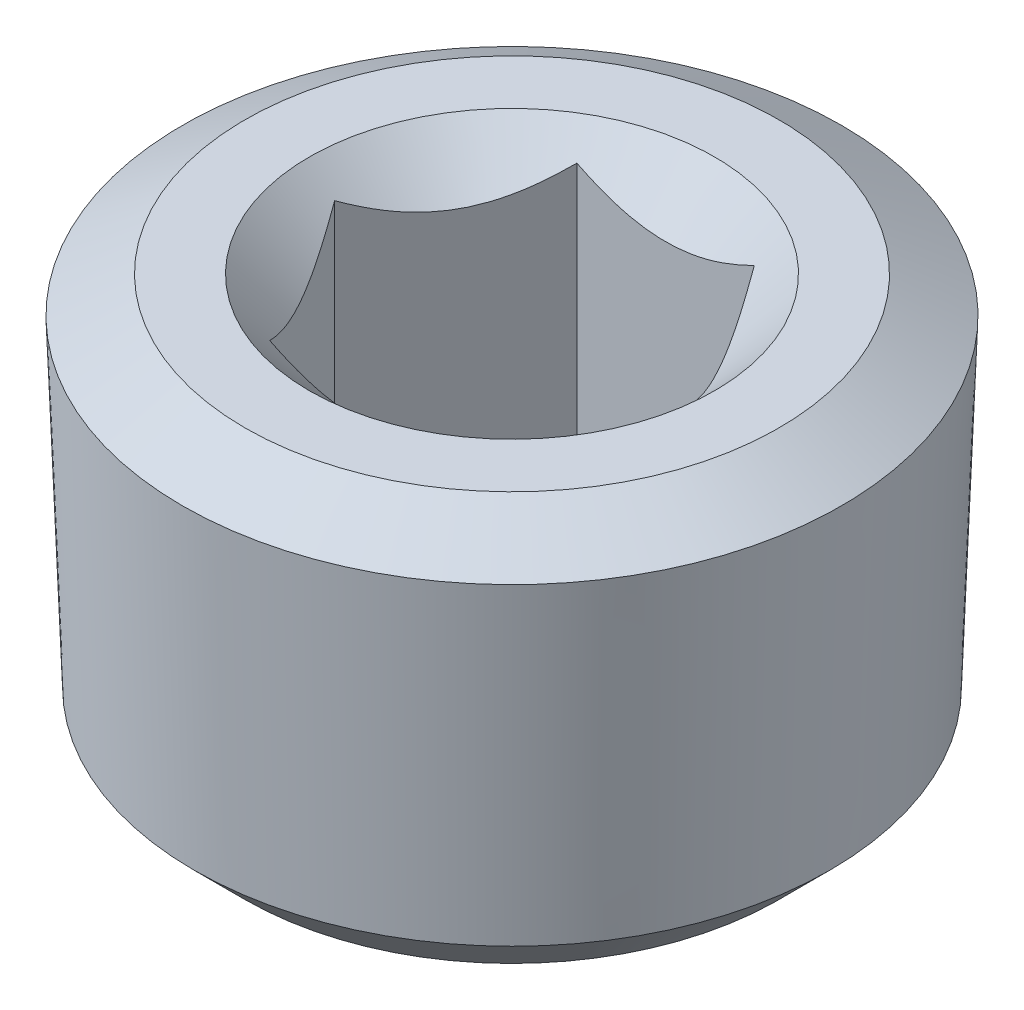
ISO-10303-21;
HEADER;
FILE_DESCRIPTION(('STEP AP214'),'2;1');
FILE_NAME('part.step','',(''),(''),'','','');
FILE_SCHEMA(('AUTOMOTIVE_DESIGN { 1 0 10303 214 1 1 1 1 }'));
ENDSEC;
DATA;
#1=APPLICATION_CONTEXT('core data for automotive mechanical design processes');
#2=APPLICATION_PROTOCOL_DEFINITION('international standard','automotive_design',2000,#1);
#3=PRODUCT_CONTEXT('',#1,'mechanical');
#4=PRODUCT('Part','Part','',(#3));
#5=PRODUCT_RELATED_PRODUCT_CATEGORY('part','',(#4));
#6=PRODUCT_DEFINITION_FORMATION('','',#4);
#7=PRODUCT_DEFINITION_CONTEXT('part definition',#1,'design');
#8=PRODUCT_DEFINITION('design','',#6,#7);
#9=PRODUCT_DEFINITION_SHAPE('','',#8);
#10=(LENGTH_UNIT() NAMED_UNIT(*) SI_UNIT(.MILLI.,.METRE.));
#11=(NAMED_UNIT(*) PLANE_ANGLE_UNIT() SI_UNIT($,.RADIAN.));
#12=(NAMED_UNIT(*) SI_UNIT($,.STERADIAN.) SOLID_ANGLE_UNIT());
#13=UNCERTAINTY_MEASURE_WITH_UNIT(LENGTH_MEASURE(1.E-05),#10,'distance_accuracy_value','');
#14=(GEOMETRIC_REPRESENTATION_CONTEXT(3) GLOBAL_UNCERTAINTY_ASSIGNED_CONTEXT((#13)) GLOBAL_UNIT_ASSIGNED_CONTEXT((#10,
#11,#12)) REPRESENTATION_CONTEXT('',''));
#15=CARTESIAN_POINT('',(0.,0.,0.));
#16=DIRECTION('',(0.,0.,1.));
#17=DIRECTION('',(1.,0.,0.));
#18=AXIS2_PLACEMENT_3D('',#15,#16,#17);
#19=CARTESIAN_POINT('',(0.,0.,0.));
#20=DIRECTION('',(0.,1.,0.));
#21=DIRECTION('',(0.,0.,1.));
#22=AXIS2_PLACEMENT_3D('',#19,#20,#21);
#23=PLANE('',#22);
#24=CARTESIAN_POINT('',(0.,0.,0.));
#25=DIRECTION('',(0.,1.,0.));
#26=DIRECTION('',(0.,0.,1.));
#27=AXIS2_PLACEMENT_3D('',#24,#25,#26);
#28=CIRCLE('',#27,3.1496);
#29=CARTESIAN_POINT('',(0.,0.,3.1496));
#30=VERTEX_POINT('',#29);
#31=EDGE_CURVE('E238',#30,#30,#28,.T.);
#32=ORIENTED_EDGE('',*,*,#31,.F.);
#33=EDGE_LOOP('',(#32));
#34=FACE_BOUND('',#33,.T.);
#35=CARTESIAN_POINT('',(0.,0.,0.));
#36=DIRECTION('',(0.,1.,0.));
#37=DIRECTION('',(0.,0.,1.));
#38=AXIS2_PLACEMENT_3D('',#35,#36,#37);
#39=CIRCLE('',#38,4.14998778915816);
#40=CARTESIAN_POINT('',(0.,0.,4.14998778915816));
#41=VERTEX_POINT('',#40);
#42=EDGE_CURVE('E12',#41,#41,#39,.T.);
#43=ORIENTED_EDGE('',*,*,#42,.T.);
#44=EDGE_LOOP('',(#43));
#45=FACE_BOUND('',#44,.T.);
#46=ADVANCED_FACE('F33',(#34,#45),#23,.T.);
#47=CARTESIAN_POINT('',(0.,0.,0.));
#48=DIRECTION('',(0.,-1.,0.));
#49=DIRECTION('',(0.,0.,-1.));
#50=AXIS2_PLACEMENT_3D('',#47,#48,#49);
#51=CONICAL_SURFACE('',#50,4.14998778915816,1.0471975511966);
#52=CARTESIAN_POINT('',(0.,-0.561779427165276,0.));
#53=DIRECTION('',(0.,1.,0.));
#54=DIRECTION('',(0.,0.,1.));
#55=AXIS2_PLACEMENT_3D('',#52,#53,#54);
#56=CIRCLE('',#55,5.12301829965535);
#57=CARTESIAN_POINT('',(0.,-0.561779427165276,5.12301829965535));
#58=VERTEX_POINT('',#57);
#59=EDGE_CURVE('E40',#58,#58,#56,.T.);
#60=ORIENTED_EDGE('',*,*,#59,.T.);
#61=EDGE_LOOP('',(#60));
#62=FACE_BOUND('',#61,.T.);
#63=ORIENTED_EDGE('',*,*,#42,.F.);
#64=EDGE_LOOP('',(#63));
#65=FACE_BOUND('',#64,.T.);
#66=ADVANCED_FACE('F228',(#62,#65),#51,.T.);
#67=CARTESIAN_POINT('',(0.,-0.561779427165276,0.));
#68=DIRECTION('',(0.,1.,0.));
#69=DIRECTION('',(0.,0.,1.));
#70=AXIS2_PLACEMENT_3D('',#67,#68,#69);
#71=CONICAL_SURFACE('',#70,5.12301829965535,0.0364424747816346);
#72=CARTESIAN_POINT('',(0.,-5.55916733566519,0.));
#73=DIRECTION('',(0.,1.,0.));
#74=DIRECTION('',(0.,0.,1.));
#75=AXIS2_PLACEMENT_3D('',#72,#73,#74);
#76=CIRCLE('',#75,4.94082045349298);
#77=CARTESIAN_POINT('',(0.,-5.55916733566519,4.94082045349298));
#78=VERTEX_POINT('',#77);
#79=EDGE_CURVE('E246',#78,#78,#76,.T.);
#80=ORIENTED_EDGE('',*,*,#79,.T.);
#81=EDGE_LOOP('',(#80));
#82=FACE_BOUND('',#81,.T.);
#83=ORIENTED_EDGE('',*,*,#59,.F.);
#84=EDGE_LOOP('',(#83));
#85=FACE_BOUND('',#84,.T.);
#86=ADVANCED_FACE('F233',(#82,#85),#71,.T.);
#87=CARTESIAN_POINT('',(0.,-5.55916733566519,0.));
#88=DIRECTION('',(0.,1.,0.));
#89=DIRECTION('',(0.,0.,1.));
#90=AXIS2_PLACEMENT_3D('',#87,#88,#89);
#91=CONICAL_SURFACE('',#90,4.94082045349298,0.785398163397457);
#92=CARTESIAN_POINT('',(0.,-6.35,0.));
#93=DIRECTION('',(0.,1.,0.));
#94=DIRECTION('',(0.,0.,1.));
#95=AXIS2_PLACEMENT_3D('',#92,#93,#94);
#96=CIRCLE('',#95,4.14998778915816);
#97=CARTESIAN_POINT('',(0.,-6.35,4.14998778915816));
#98=VERTEX_POINT('',#97);
#99=EDGE_CURVE('E242',#98,#98,#96,.T.);
#100=ORIENTED_EDGE('',*,*,#99,.T.);
#101=EDGE_LOOP('',(#100));
#102=FACE_BOUND('',#101,.T.);
#103=ORIENTED_EDGE('',*,*,#79,.F.);
#104=EDGE_LOOP('',(#103));
#105=FACE_BOUND('',#104,.T.);
#106=ADVANCED_FACE('F257',(#102,#105),#91,.T.);
#107=CARTESIAN_POINT('',(-4.14998778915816,-6.35,0.));
#108=DIRECTION('',(0.,-1.,0.));
#109=DIRECTION('',(0.,0.,-1.));
#110=AXIS2_PLACEMENT_3D('',#107,#108,#109);
#111=PLANE('',#110);
#112=ORIENTED_EDGE('',*,*,#99,.F.);
#113=EDGE_LOOP('',(#112));
#114=FACE_BOUND('',#113,.T.);
#115=ADVANCED_FACE('F175',(#114),#111,.T.);
#116=CARTESIAN_POINT('',(0.,0.,0.));
#117=DIRECTION('',(0.,1.,0.));
#118=DIRECTION('',(0.,0.,1.));
#119=AXIS2_PLACEMENT_3D('',#116,#117,#118);
#120=CONICAL_SURFACE('',#119,3.1496,0.785398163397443);
#121=CARTESIAN_POINT('',(-3.46242077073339,1.05622826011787,2.3876));
#122=CARTESIAN_POINT('',(-3.37526911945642,0.984499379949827,2.3876));
#123=CARTESIAN_POINT('',(-3.28770245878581,0.913266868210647,2.3876));
#124=CARTESIAN_POINT('',(-3.11152582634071,0.772059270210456,2.3876));
#125=CARTESIAN_POINT('',(-3.02291559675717,0.702084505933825,2.3876));
#126=CARTESIAN_POINT('',(-2.84349874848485,0.562930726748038,2.3876));
#127=CARTESIAN_POINT('',(-2.75267868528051,0.493768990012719,2.3876));
#128=CARTESIAN_POINT('',(-2.56954860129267,0.357460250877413,2.3876));
#129=CARTESIAN_POINT('',(-2.47723872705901,0.290313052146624,2.3876));
#130=CARTESIAN_POINT('',(-2.28188792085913,0.152280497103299,2.3876));
#131=CARTESIAN_POINT('',(-2.17866480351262,0.0816515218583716,2.3876));
#132=CARTESIAN_POINT('',(-1.96947715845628,-0.0555359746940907,2.3876));
#133=CARTESIAN_POINT('',(-1.86351173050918,-0.122093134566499,2.3876));
#134=CARTESIAN_POINT('',(-1.64874800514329,-0.249332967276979,2.3876));
#135=CARTESIAN_POINT('',(-1.53996523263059,-0.310041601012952,2.3876));
#136=CARTESIAN_POINT('',(-1.31849805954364,-0.423788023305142,2.3876));
#137=CARTESIAN_POINT('',(-1.20581720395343,-0.476832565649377,2.3876));
#138=CARTESIAN_POINT('',(-1.00970710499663,-0.558326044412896,2.3876));
#139=CARTESIAN_POINT('',(-0.92738768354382,-0.589426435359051,2.3876));
#140=CARTESIAN_POINT('',(-0.760502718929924,-0.645041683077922,2.3876));
#141=CARTESIAN_POINT('',(-0.675936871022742,-0.669555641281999,2.3876));
#142=CARTESIAN_POINT('',(-0.506786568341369,-0.710155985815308,2.3876));
#143=CARTESIAN_POINT('',(-0.422245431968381,-0.726419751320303,2.3876));
#144=CARTESIAN_POINT('',(-0.251935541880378,-0.750223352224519,2.3876));
#145=CARTESIAN_POINT('',(-0.166167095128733,-0.757765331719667,2.3876));
#146=CARTESIAN_POINT('',(0.00107034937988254,-0.763383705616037,2.3876));
#147=CARTESIAN_POINT('',(0.0825230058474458,-0.761946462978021,2.3876));
#148=CARTESIAN_POINT('',(0.244859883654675,-0.750844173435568,2.3876));
#149=CARTESIAN_POINT('',(0.325744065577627,-0.741178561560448,2.3876));
#150=CARTESIAN_POINT('',(0.487775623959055,-0.71402033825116,2.3876));
#151=CARTESIAN_POINT('',(0.568897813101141,-0.696379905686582,2.3876));
#152=CARTESIAN_POINT('',(0.729317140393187,-0.654295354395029,2.3876));
#153=CARTESIAN_POINT('',(0.808614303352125,-0.629851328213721,2.3876));
#154=CARTESIAN_POINT('',(1.04680074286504,-0.546928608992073,2.3876));
#155=CARTESIAN_POINT('',(1.20258605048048,-0.479514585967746,2.3876));
#156=CARTESIAN_POINT('',(1.43061079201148,-0.36699056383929,2.3876));
#157=CARTESIAN_POINT('',(1.50581378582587,-0.32749643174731,2.3876));
#158=CARTESIAN_POINT('',(1.65452246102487,-0.245425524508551,2.3876));
#159=CARTESIAN_POINT('',(1.72802843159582,-0.202849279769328,2.3876));
#160=CARTESIAN_POINT('',(1.86994165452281,-0.117394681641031,2.3876));
#161=CARTESIAN_POINT('',(1.93842134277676,-0.0746352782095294,2.3876));
#162=CARTESIAN_POINT('',(2.07420549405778,0.0127190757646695,2.3876));
#163=CARTESIAN_POINT('',(2.14150986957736,0.0573141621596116,2.3876));
#164=CARTESIAN_POINT('',(2.27455924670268,0.147653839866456,2.3876));
#165=CARTESIAN_POINT('',(2.34031238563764,0.19338649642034,2.3876));
#166=CARTESIAN_POINT('',(2.47091456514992,0.286088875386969,2.3876));
#167=CARTESIAN_POINT('',(2.53576384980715,0.333058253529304,2.3876));
#168=CARTESIAN_POINT('',(2.60023368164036,0.380534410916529,2.3876));
#169=B_SPLINE_CURVE_WITH_KNOTS('',3,(#121,#122,#123,#124,#125,#126,#127,#128,#129,#130,#131,
#132,#133,#134,#135,#136,#137,#138,#139,#140,#141,#142,#143,#144,#145,#146,#147,#148,#149,#150,
#151,#152,#153,#154,#155,#156,#157,#158,#159,#160,#161,#162,#163,#164,#165,#166,#167,#168),
.UNSPECIFIED.,.F.,.F.,(4,2,2,2,2,2,2,2,2,2,2,2,2,2,2,2,2,2,2,2,2,2,2,4),(0.,0.33862629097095,
0.677338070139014,1.01978408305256,1.3621966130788,1.73734628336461,2.11262070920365,
2.48614413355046,2.85933636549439,3.12311223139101,3.38692406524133,3.64479404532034,
3.90260061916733,4.14656864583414,4.39055342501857,4.6392589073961,4.88796100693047,
5.39563913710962,5.65044461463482,5.90520634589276,6.14737581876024,6.38956324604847,
6.62982819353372,6.87002695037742),.UNSPECIFIED.);
#170=CARTESIAN_POINT('',(1.37848150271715,-0.392636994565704,2.3876));
#171=VERTEX_POINT('',#170);
#172=CARTESIAN_POINT('',(-1.37848150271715,-0.392636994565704,2.3876));
#173=VERTEX_POINT('',#172);
#174=EDGE_CURVE('E47',#171,#173,#169,.F.);
#175=ORIENTED_EDGE('',*,*,#174,.T.);
#176=CARTESIAN_POINT('',(-1.37836603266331,-0.392521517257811,2.3878));
#177=CARTESIAN_POINT('',(-1.42575207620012,-0.439867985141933,2.30572496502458));
#178=CARTESIAN_POINT('',(-1.47393048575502,-0.484433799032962,2.22227751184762));
#179=CARTESIAN_POINT('',(-1.57217161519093,-0.566032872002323,2.05211888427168));
#180=CARTESIAN_POINT('',(-1.62224367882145,-0.603020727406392,1.96539152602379));
#181=CARTESIAN_POINT('',(-1.72321161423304,-0.666381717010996,1.79050993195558));
#182=CARTESIAN_POINT('',(-1.77408177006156,-0.692914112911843,1.70240023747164));
#183=CARTESIAN_POINT('',(-1.87694201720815,-0.733792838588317,1.52424106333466));
#184=CARTESIAN_POINT('',(-1.92892896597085,-0.748169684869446,1.4341970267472));
#185=CARTESIAN_POINT('',(-2.01852512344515,-0.761141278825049,1.27901192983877));
#186=CARTESIAN_POINT('',(-2.05601857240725,-0.763061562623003,1.2140713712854));
#187=CARTESIAN_POINT('',(-2.13094418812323,-0.759826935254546,1.08429639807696));
#188=CARTESIAN_POINT('',(-2.16837632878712,-0.754669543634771,1.01946202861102));
#189=CARTESIAN_POINT('',(-2.24288716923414,-0.737573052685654,0.890405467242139));
#190=CARTESIAN_POINT('',(-2.2799654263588,-0.725626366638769,0.826184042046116));
#191=CARTESIAN_POINT('',(-2.35348076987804,-0.695607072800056,0.698851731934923));
#192=CARTESIAN_POINT('',(-2.38991790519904,-0.677534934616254,0.635740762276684));
#193=CARTESIAN_POINT('',(-2.48325004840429,-0.623883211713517,0.474084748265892));
#194=CARTESIAN_POINT('',(-2.53956632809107,-0.584259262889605,0.376542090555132));
#195=CARTESIAN_POINT('',(-2.62237445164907,-0.517368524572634,0.233114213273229));
#196=CARTESIAN_POINT('',(-2.64966342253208,-0.493866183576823,0.185848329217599));
#197=CARTESIAN_POINT('',(-2.70373586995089,-0.444719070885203,0.092192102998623));
#198=CARTESIAN_POINT('',(-2.73051964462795,-0.419075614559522,0.045801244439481));
#199=CARTESIAN_POINT('',(-2.75707847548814,-0.39252151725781,-0.000199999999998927));
#200=B_SPLINE_CURVE_WITH_KNOTS('',3,(#176,#177,#178,#179,#180,#181,#182,#183,#184,#185,#186,
#187,#188,#189,#190,#191,#192,#193,#194,#195,#196,#197,#198,#199),.UNSPECIFIED.,.F.,.F.,(4,2,2,
2,2,2,2,2,2,2,2,4),(0.,0.318042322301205,0.637937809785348,0.952752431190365,1.26677434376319,
1.49149028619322,1.71628500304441,1.94133141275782,2.16636057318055,2.52380766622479,
2.70204658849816,2.88017680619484),.UNSPECIFIED.);
#201=CARTESIAN_POINT('',(-2.7569630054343,-0.392636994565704,0.));
#202=VERTEX_POINT('',#201);
#203=EDGE_CURVE('E119',#173,#202,#200,.T.);
#204=ORIENTED_EDGE('',*,*,#203,.T.);
#205=CARTESIAN_POINT('',(-2.75707847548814,-0.39252151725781,0.000200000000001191));
#206=CARTESIAN_POINT('',(-2.70969243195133,-0.439867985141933,-0.0818750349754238));
#207=CARTESIAN_POINT('',(-2.66151402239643,-0.484433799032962,-0.165322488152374));
#208=CARTESIAN_POINT('',(-2.56327289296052,-0.566032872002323,-0.335481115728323));
#209=CARTESIAN_POINT('',(-2.51320082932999,-0.603020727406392,-0.422208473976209));
#210=CARTESIAN_POINT('',(-2.4122328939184,-0.666381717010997,-0.597090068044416));
#211=CARTESIAN_POINT('',(-2.36136273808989,-0.692914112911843,-0.685199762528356));
#212=CARTESIAN_POINT('',(-2.2585024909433,-0.733792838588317,-0.863358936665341));
#213=CARTESIAN_POINT('',(-2.2065155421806,-0.748169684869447,-0.953402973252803));
#214=CARTESIAN_POINT('',(-2.1169193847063,-0.76114127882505,-1.10858807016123));
#215=CARTESIAN_POINT('',(-2.07942593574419,-0.763061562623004,-1.1735286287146));
#216=CARTESIAN_POINT('',(-2.00450032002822,-0.759826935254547,-1.30330360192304));
#217=CARTESIAN_POINT('',(-1.96706817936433,-0.754669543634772,-1.36813797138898));
#218=CARTESIAN_POINT('',(-1.89255733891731,-0.737573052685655,-1.49719453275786));
#219=CARTESIAN_POINT('',(-1.85547908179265,-0.725626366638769,-1.56141595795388));
#220=CARTESIAN_POINT('',(-1.78196373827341,-0.695607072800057,-1.68874826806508));
#221=CARTESIAN_POINT('',(-1.74552660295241,-0.677534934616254,-1.75185923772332));
#222=CARTESIAN_POINT('',(-1.65219445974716,-0.623883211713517,-1.91351525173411));
#223=CARTESIAN_POINT('',(-1.59587818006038,-0.584259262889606,-2.01105790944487));
#224=CARTESIAN_POINT('',(-1.51307005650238,-0.517368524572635,-2.15448578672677));
#225=CARTESIAN_POINT('',(-1.48578108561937,-0.493866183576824,-2.2017516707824));
#226=CARTESIAN_POINT('',(-1.43170863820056,-0.444719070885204,-2.29540789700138));
#227=CARTESIAN_POINT('',(-1.4049248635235,-0.419075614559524,-2.34179875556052));
#228=CARTESIAN_POINT('',(-1.37836603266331,-0.392521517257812,-2.3878));
#229=B_SPLINE_CURVE_WITH_KNOTS('',3,(#205,#206,#207,#208,#209,#210,#211,#212,#213,#214,#215,
#216,#217,#218,#219,#220,#221,#222,#223,#224,#225,#226,#227,#228),.UNSPECIFIED.,.F.,.F.,(4,2,2,
2,2,2,2,2,2,2,2,4),(0.,0.318042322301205,0.637937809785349,0.952752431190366,1.26677434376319,
1.49149028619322,1.71628500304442,1.94133141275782,2.16636057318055,2.52380766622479,
2.70204658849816,2.88017680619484),.UNSPECIFIED.);
#230=CARTESIAN_POINT('',(-1.37848150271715,-0.392636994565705,-2.3876));
#231=VERTEX_POINT('',#230);
#232=EDGE_CURVE('E197',#202,#231,#229,.T.);
#233=ORIENTED_EDGE('',*,*,#232,.T.);
#234=CARTESIAN_POINT('',(-3.46242077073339,1.05622826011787,-2.3876));
#235=CARTESIAN_POINT('',(-3.37526911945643,0.984499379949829,-2.3876));
#236=CARTESIAN_POINT('',(-3.28770245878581,0.91326686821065,-2.3876));
#237=CARTESIAN_POINT('',(-3.11152582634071,0.772059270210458,-2.3876));
#238=CARTESIAN_POINT('',(-3.02291559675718,0.702084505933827,-2.3876));
#239=CARTESIAN_POINT('',(-2.84349874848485,0.56293072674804,-2.3876));
#240=CARTESIAN_POINT('',(-2.75267868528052,0.49376899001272,-2.3876));
#241=CARTESIAN_POINT('',(-2.56954860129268,0.357460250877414,-2.3876));
#242=CARTESIAN_POINT('',(-2.47723872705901,0.290313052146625,-2.3876));
#243=CARTESIAN_POINT('',(-2.28188792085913,0.1522804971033,-2.3876));
#244=CARTESIAN_POINT('',(-2.17866480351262,0.081651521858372,-2.3876));
#245=CARTESIAN_POINT('',(-1.96947715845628,-0.0555359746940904,-2.3876));
#246=CARTESIAN_POINT('',(-1.86351173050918,-0.122093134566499,-2.3876));
#247=CARTESIAN_POINT('',(-1.64874800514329,-0.249332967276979,-2.3876));
#248=CARTESIAN_POINT('',(-1.53996523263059,-0.310041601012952,-2.3876));
#249=CARTESIAN_POINT('',(-1.31849805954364,-0.423788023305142,-2.3876));
#250=CARTESIAN_POINT('',(-1.20581720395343,-0.476832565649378,-2.3876));
#251=CARTESIAN_POINT('',(-1.00970710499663,-0.558326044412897,-2.3876));
#252=CARTESIAN_POINT('',(-0.92738768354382,-0.589426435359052,-2.3876));
#253=CARTESIAN_POINT('',(-0.760502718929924,-0.645041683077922,-2.3876));
#254=CARTESIAN_POINT('',(-0.675936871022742,-0.669555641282,-2.3876));
#255=CARTESIAN_POINT('',(-0.506786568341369,-0.710155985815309,-2.3876));
#256=CARTESIAN_POINT('',(-0.422245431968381,-0.726419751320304,-2.3876));
#257=CARTESIAN_POINT('',(-0.251935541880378,-0.750223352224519,-2.3876));
#258=CARTESIAN_POINT('',(-0.166167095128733,-0.757765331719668,-2.3876));
#259=CARTESIAN_POINT('',(0.00107034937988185,-0.763383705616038,-2.3876));
#260=CARTESIAN_POINT('',(0.0825230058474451,-0.761946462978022,-2.3876));
#261=CARTESIAN_POINT('',(0.244859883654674,-0.750844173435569,-2.3876));
#262=CARTESIAN_POINT('',(0.325744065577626,-0.741178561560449,-2.3876));
#263=CARTESIAN_POINT('',(0.487775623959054,-0.714020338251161,-2.3876));
#264=CARTESIAN_POINT('',(0.56889781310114,-0.696379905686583,-2.3876));
#265=CARTESIAN_POINT('',(0.729317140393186,-0.65429535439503,-2.3876));
#266=CARTESIAN_POINT('',(0.808614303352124,-0.629851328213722,-2.3876));
#267=CARTESIAN_POINT('',(1.04680074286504,-0.546928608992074,-2.3876));
#268=CARTESIAN_POINT('',(1.20258605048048,-0.479514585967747,-2.3876));
#269=CARTESIAN_POINT('',(1.43061079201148,-0.366990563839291,-2.3876));
#270=CARTESIAN_POINT('',(1.50581378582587,-0.327496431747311,-2.3876));
#271=CARTESIAN_POINT('',(1.65452246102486,-0.245425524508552,-2.3876));
#272=CARTESIAN_POINT('',(1.72802843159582,-0.202849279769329,-2.3876));
#273=CARTESIAN_POINT('',(1.86994165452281,-0.117394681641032,-2.3876));
#274=CARTESIAN_POINT('',(1.93842134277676,-0.0746352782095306,-2.3876));
#275=CARTESIAN_POINT('',(2.07420549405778,0.0127190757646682,-2.3876));
#276=CARTESIAN_POINT('',(2.14150986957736,0.0573141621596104,-2.3876));
#277=CARTESIAN_POINT('',(2.27455924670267,0.147653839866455,-2.3876));
#278=CARTESIAN_POINT('',(2.34031238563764,0.193386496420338,-2.3876));
#279=CARTESIAN_POINT('',(2.47091456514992,0.286088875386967,-2.3876));
#280=CARTESIAN_POINT('',(2.53576384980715,0.333058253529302,-2.3876));
#281=CARTESIAN_POINT('',(2.60023368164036,0.380534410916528,-2.3876));
#282=B_SPLINE_CURVE_WITH_KNOTS('',3,(#234,#235,#236,#237,#238,#239,#240,#241,#242,#243,#244,
#245,#246,#247,#248,#249,#250,#251,#252,#253,#254,#255,#256,#257,#258,#259,#260,#261,#262,#263,
#264,#265,#266,#267,#268,#269,#270,#271,#272,#273,#274,#275,#276,#277,#278,#279,#280,#281),
.UNSPECIFIED.,.F.,.F.,(4,2,2,2,2,2,2,2,2,2,2,2,2,2,2,2,2,2,2,2,2,2,2,4),(0.,0.338626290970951,
0.677338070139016,1.01978408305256,1.3621966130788,1.73734628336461,2.11262070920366,
2.48614413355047,2.85933636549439,3.12311223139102,3.38692406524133,3.64479404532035,
3.90260061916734,4.14656864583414,4.39055342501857,4.6392589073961,4.88796100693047,
5.39563913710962,5.65044461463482,5.90520634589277,6.14737581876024,6.38956324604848,
6.62982819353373,6.87002695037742),.UNSPECIFIED.);
#283=CARTESIAN_POINT('',(1.37848150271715,-0.392636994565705,-2.3876));
#284=VERTEX_POINT('',#283);
#285=EDGE_CURVE('E191',#231,#284,#282,.T.);
#286=ORIENTED_EDGE('',*,*,#285,.T.);
#287=CARTESIAN_POINT('',(1.37836603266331,-0.392521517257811,-2.3878));
#288=CARTESIAN_POINT('',(1.42575207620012,-0.439867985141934,-2.30572496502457));
#289=CARTESIAN_POINT('',(1.47393048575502,-0.484433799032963,-2.22227751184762));
#290=CARTESIAN_POINT('',(1.57217161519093,-0.566032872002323,-2.05211888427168));
#291=CARTESIAN_POINT('',(1.62224367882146,-0.603020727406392,-1.96539152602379));
#292=CARTESIAN_POINT('',(1.72321161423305,-0.666381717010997,-1.79050993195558));
#293=CARTESIAN_POINT('',(1.77408177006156,-0.692914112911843,-1.70240023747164));
#294=CARTESIAN_POINT('',(1.87694201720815,-0.733792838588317,-1.52424106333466));
#295=CARTESIAN_POINT('',(1.92892896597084,-0.748169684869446,-1.4341970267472));
#296=CARTESIAN_POINT('',(2.01852512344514,-0.76114127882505,-1.27901192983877));
#297=CARTESIAN_POINT('',(2.05601857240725,-0.763061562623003,-1.2140713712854));
#298=CARTESIAN_POINT('',(2.13094418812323,-0.759826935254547,-1.08429639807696));
#299=CARTESIAN_POINT('',(2.16837632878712,-0.754669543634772,-1.01946202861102));
#300=CARTESIAN_POINT('',(2.24288716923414,-0.737573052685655,-0.89040546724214));
#301=CARTESIAN_POINT('',(2.2799654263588,-0.725626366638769,-0.826184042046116));
#302=CARTESIAN_POINT('',(2.35348076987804,-0.695607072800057,-0.698851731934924));
#303=CARTESIAN_POINT('',(2.38991790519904,-0.677534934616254,-0.635740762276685));
#304=CARTESIAN_POINT('',(2.48325004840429,-0.623883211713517,-0.474084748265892));
#305=CARTESIAN_POINT('',(2.53956632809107,-0.584259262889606,-0.376542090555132));
#306=CARTESIAN_POINT('',(2.62237445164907,-0.517368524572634,-0.233114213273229));
#307=CARTESIAN_POINT('',(2.64966342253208,-0.493866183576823,-0.185848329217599));
#308=CARTESIAN_POINT('',(2.70373586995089,-0.444719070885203,-0.0921921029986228));
#309=CARTESIAN_POINT('',(2.73051964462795,-0.419075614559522,-0.0458012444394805));
#310=CARTESIAN_POINT('',(2.75707847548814,-0.39252151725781,0.000199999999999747));
#311=B_SPLINE_CURVE_WITH_KNOTS('',3,(#287,#288,#289,#290,#291,#292,#293,#294,#295,#296,#297,
#298,#299,#300,#301,#302,#303,#304,#305,#306,#307,#308,#309,#310),.UNSPECIFIED.,.F.,.F.,(4,2,2,
2,2,2,2,2,2,2,2,4),(0.,0.318042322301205,0.637937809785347,0.952752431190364,1.26677434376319,
1.49149028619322,1.71628500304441,1.94133141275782,2.16636057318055,2.52380766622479,
2.70204658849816,2.88017680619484),.UNSPECIFIED.);
#312=CARTESIAN_POINT('',(2.7569630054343,-0.392636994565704,0.));
#313=VERTEX_POINT('',#312);
#314=EDGE_CURVE('E185',#284,#313,#311,.T.);
#315=ORIENTED_EDGE('',*,*,#314,.T.);
#316=CARTESIAN_POINT('',(2.75707847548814,-0.39252151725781,-0.000200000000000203));
#317=CARTESIAN_POINT('',(2.70969243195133,-0.439867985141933,0.0818750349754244));
#318=CARTESIAN_POINT('',(2.66151402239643,-0.484433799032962,0.165322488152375));
#319=CARTESIAN_POINT('',(2.56327289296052,-0.566032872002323,0.335481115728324));
#320=CARTESIAN_POINT('',(2.51320082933,-0.603020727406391,0.422208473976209));
#321=CARTESIAN_POINT('',(2.41223289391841,-0.666381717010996,0.597090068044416));
#322=CARTESIAN_POINT('',(2.36136273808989,-0.692914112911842,0.685199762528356));
#323=CARTESIAN_POINT('',(2.2585024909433,-0.733792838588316,0.86335893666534));
#324=CARTESIAN_POINT('',(2.20651554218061,-0.748169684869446,0.953402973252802));
#325=CARTESIAN_POINT('',(2.11691938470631,-0.761141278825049,1.10858807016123));
#326=CARTESIAN_POINT('',(2.0794259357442,-0.763061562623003,1.1735286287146));
#327=CARTESIAN_POINT('',(2.00450032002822,-0.759826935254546,1.30330360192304));
#328=CARTESIAN_POINT('',(1.96706817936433,-0.754669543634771,1.36813797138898));
#329=CARTESIAN_POINT('',(1.89255733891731,-0.737573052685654,1.49719453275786));
#330=CARTESIAN_POINT('',(1.85547908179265,-0.725626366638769,1.56141595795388));
#331=CARTESIAN_POINT('',(1.78196373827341,-0.695607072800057,1.68874826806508));
#332=CARTESIAN_POINT('',(1.74552660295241,-0.677534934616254,1.75185923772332));
#333=CARTESIAN_POINT('',(1.65219445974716,-0.623883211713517,1.91351525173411));
#334=CARTESIAN_POINT('',(1.59587818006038,-0.584259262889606,2.01105790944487));
#335=CARTESIAN_POINT('',(1.51307005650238,-0.517368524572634,2.15448578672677));
#336=CARTESIAN_POINT('',(1.48578108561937,-0.493866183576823,2.2017516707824));
#337=CARTESIAN_POINT('',(1.43170863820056,-0.444719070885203,2.29540789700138));
#338=CARTESIAN_POINT('',(1.4049248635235,-0.419075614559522,2.34179875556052));
#339=CARTESIAN_POINT('',(1.37836603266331,-0.39252151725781,2.3878));
#340=B_SPLINE_CURVE_WITH_KNOTS('',3,(#316,#317,#318,#319,#320,#321,#322,#323,#324,#325,#326,
#327,#328,#329,#330,#331,#332,#333,#334,#335,#336,#337,#338,#339),.UNSPECIFIED.,.F.,.F.,(4,2,2,
2,2,2,2,2,2,2,2,4),(0.,0.318042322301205,0.637937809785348,0.952752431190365,1.26677434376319,
1.49149028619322,1.71628500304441,1.94133141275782,2.16636057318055,2.52380766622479,
2.70204658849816,2.88017680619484),.UNSPECIFIED.);
#341=EDGE_CURVE('E162',#313,#171,#340,.T.);
#342=ORIENTED_EDGE('',*,*,#341,.T.);
#343=EDGE_LOOP('',(#175,#204,#233,#286,#315,#342));
#344=FACE_BOUND('',#343,.T.);
#345=ORIENTED_EDGE('',*,*,#31,.T.);
#346=EDGE_LOOP('',(#345));
#347=FACE_BOUND('',#346,.T.);
#348=ADVANCED_FACE('F170',(#344,#347),#120,.F.);
#349=CARTESIAN_POINT('',(-2.7569630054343,-4.318,0.));
#350=DIRECTION('',(-0.866025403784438,0.,0.500000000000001));
#351=DIRECTION('',(0.500000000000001,0.,0.866025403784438));
#352=AXIS2_PLACEMENT_3D('',#349,#350,#351);
#353=PLANE('',#352);
#354=DIRECTION('',(0.,1.,0.));
#355=VECTOR('',#354,1.);
#356=CARTESIAN_POINT('',(-1.37848150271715,-4.318,2.3876));
#357=LINE('',#356,#355);
#358=CARTESIAN_POINT('',(-1.37848150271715,-4.318,2.3876));
#359=VERTEX_POINT('',#358);
#360=EDGE_CURVE('E116',#359,#173,#357,.T.);
#361=ORIENTED_EDGE('',*,*,#360,.F.);
#362=DIRECTION('',(0.5,0.,0.866025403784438));
#363=VECTOR('',#362,1.);
#364=CARTESIAN_POINT('',(-2.7569630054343,-4.318,0.));
#365=LINE('',#364,#363);
#366=CARTESIAN_POINT('',(-2.06772225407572,-4.318,1.1938));
#367=VERTEX_POINT('',#366);
#368=EDGE_CURVE('E103',#367,#359,#365,.T.);
#369=ORIENTED_EDGE('',*,*,#368,.F.);
#370=CARTESIAN_POINT('',(-2.7569630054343,-4.318,0.));
#371=VERTEX_POINT('',#370);
#372=EDGE_CURVE('E113',#371,#367,#365,.T.);
#373=ORIENTED_EDGE('',*,*,#372,.F.);
#374=DIRECTION('',(0.,1.,0.));
#375=VECTOR('',#374,1.);
#376=CARTESIAN_POINT('',(-2.7569630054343,-4.318,0.));
#377=LINE('',#376,#375);
#378=EDGE_CURVE('E143',#371,#202,#377,.T.);
#379=ORIENTED_EDGE('',*,*,#378,.T.);
#380=ORIENTED_EDGE('',*,*,#203,.F.);
#381=EDGE_LOOP('',(#361,#369,#373,#379,#380));
#382=FACE_BOUND('',#381,.T.);
#383=ADVANCED_FACE('F117',(#382),#353,.F.);
#384=CARTESIAN_POINT('',(-1.37848150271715,-4.318,-2.3876));
#385=DIRECTION('',(-0.866025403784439,0.,-0.5));
#386=DIRECTION('',(-0.5,0.,0.866025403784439));
#387=AXIS2_PLACEMENT_3D('',#384,#385,#386);
#388=PLANE('',#387);
#389=ORIENTED_EDGE('',*,*,#378,.F.);
#390=DIRECTION('',(-0.5,0.,0.866025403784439));
#391=VECTOR('',#390,1.);
#392=CARTESIAN_POINT('',(-1.37848150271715,-4.318,-2.3876));
#393=LINE('',#392,#391);
#394=CARTESIAN_POINT('',(-2.06772225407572,-4.318,-1.1938));
#395=VERTEX_POINT('',#394);
#396=EDGE_CURVE('E140',#395,#371,#393,.T.);
#397=ORIENTED_EDGE('',*,*,#396,.F.);
#398=CARTESIAN_POINT('',(-1.37848150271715,-4.318,-2.3876));
#399=VERTEX_POINT('',#398);
#400=EDGE_CURVE('E122',#399,#395,#393,.T.);
#401=ORIENTED_EDGE('',*,*,#400,.F.);
#402=DIRECTION('',(0.,1.,0.));
#403=VECTOR('',#402,1.);
#404=CARTESIAN_POINT('',(-1.37848150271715,-4.318,-2.3876));
#405=LINE('',#404,#403);
#406=EDGE_CURVE('E145',#399,#231,#405,.T.);
#407=ORIENTED_EDGE('',*,*,#406,.T.);
#408=ORIENTED_EDGE('',*,*,#232,.F.);
#409=EDGE_LOOP('',(#389,#397,#401,#407,#408));
#410=FACE_BOUND('',#409,.T.);
#411=ADVANCED_FACE('F206',(#410),#388,.F.);
#412=CARTESIAN_POINT('',(1.37848150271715,-4.318,-2.3876));
#413=DIRECTION('',(0.,0.,-1.));
#414=DIRECTION('',(-1.,0.,0.));
#415=AXIS2_PLACEMENT_3D('',#412,#413,#414);
#416=PLANE('',#415);
#417=ORIENTED_EDGE('',*,*,#406,.F.);
#418=DIRECTION('',(-1.,0.,0.));
#419=VECTOR('',#418,1.);
#420=CARTESIAN_POINT('',(1.37848150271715,-4.318,-2.3876));
#421=LINE('',#420,#419);
#422=CARTESIAN_POINT('',(0.,-4.318,-2.3876));
#423=VERTEX_POINT('',#422);
#424=EDGE_CURVE('E136',#423,#399,#421,.T.);
#425=ORIENTED_EDGE('',*,*,#424,.F.);
#426=CARTESIAN_POINT('',(1.37848150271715,-4.318,-2.3876));
#427=VERTEX_POINT('',#426);
#428=EDGE_CURVE('E137',#427,#423,#421,.T.);
#429=ORIENTED_EDGE('',*,*,#428,.F.);
#430=DIRECTION('',(0.,1.,0.));
#431=VECTOR('',#430,1.);
#432=CARTESIAN_POINT('',(1.37848150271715,-4.318,-2.3876));
#433=LINE('',#432,#431);
#434=EDGE_CURVE('E148',#427,#284,#433,.T.);
#435=ORIENTED_EDGE('',*,*,#434,.T.);
#436=ORIENTED_EDGE('',*,*,#285,.F.);
#437=EDGE_LOOP('',(#417,#425,#429,#435,#436));
#438=FACE_BOUND('',#437,.T.);
#439=ADVANCED_FACE('F210',(#438),#416,.F.);
#440=CARTESIAN_POINT('',(2.7569630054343,-4.318,0.));
#441=DIRECTION('',(0.866025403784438,0.,-0.5));
#442=DIRECTION('',(-0.5,0.,-0.866025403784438));
#443=AXIS2_PLACEMENT_3D('',#440,#441,#442);
#444=PLANE('',#443);
#445=ORIENTED_EDGE('',*,*,#434,.F.);
#446=DIRECTION('',(-0.5,0.,-0.866025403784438));
#447=VECTOR('',#446,1.);
#448=CARTESIAN_POINT('',(2.7569630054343,-4.318,0.));
#449=LINE('',#448,#447);
#450=CARTESIAN_POINT('',(2.06772225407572,-4.318,-1.1938));
#451=VERTEX_POINT('',#450);
#452=EDGE_CURVE('E132',#451,#427,#449,.T.);
#453=ORIENTED_EDGE('',*,*,#452,.F.);
#454=CARTESIAN_POINT('',(2.7569630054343,-4.318,0.));
#455=VERTEX_POINT('',#454);
#456=EDGE_CURVE('E133',#455,#451,#449,.T.);
#457=ORIENTED_EDGE('',*,*,#456,.F.);
#458=DIRECTION('',(0.,1.,0.));
#459=VECTOR('',#458,1.);
#460=CARTESIAN_POINT('',(2.7569630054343,-4.318,0.));
#461=LINE('',#460,#459);
#462=EDGE_CURVE('E151',#455,#313,#461,.T.);
#463=ORIENTED_EDGE('',*,*,#462,.T.);
#464=ORIENTED_EDGE('',*,*,#314,.F.);
#465=EDGE_LOOP('',(#445,#453,#457,#463,#464));
#466=FACE_BOUND('',#465,.T.);
#467=ADVANCED_FACE('F214',(#466),#444,.F.);
#468=CARTESIAN_POINT('',(1.37848150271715,-4.318,2.3876));
#469=DIRECTION('',(0.866025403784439,0.,0.5));
#470=DIRECTION('',(0.5,0.,-0.866025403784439));
#471=AXIS2_PLACEMENT_3D('',#468,#469,#470);
#472=PLANE('',#471);
#473=ORIENTED_EDGE('',*,*,#462,.F.);
#474=DIRECTION('',(0.5,0.,-0.866025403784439));
#475=VECTOR('',#474,1.);
#476=CARTESIAN_POINT('',(1.37848150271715,-4.318,2.3876));
#477=LINE('',#476,#475);
#478=CARTESIAN_POINT('',(2.06772225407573,-4.318,1.1938));
#479=VERTEX_POINT('',#478);
#480=EDGE_CURVE('E128',#479,#455,#477,.T.);
#481=ORIENTED_EDGE('',*,*,#480,.F.);
#482=CARTESIAN_POINT('',(1.37848150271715,-4.318,2.3876));
#483=VERTEX_POINT('',#482);
#484=EDGE_CURVE('E55',#483,#479,#477,.T.);
#485=ORIENTED_EDGE('',*,*,#484,.F.);
#486=DIRECTION('',(0.,1.,0.));
#487=VECTOR('',#486,1.);
#488=CARTESIAN_POINT('',(1.37848150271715,-4.318,2.3876));
#489=LINE('',#488,#487);
#490=EDGE_CURVE('E121',#483,#171,#489,.T.);
#491=ORIENTED_EDGE('',*,*,#490,.T.);
#492=ORIENTED_EDGE('',*,*,#341,.F.);
#493=EDGE_LOOP('',(#473,#481,#485,#491,#492));
#494=FACE_BOUND('',#493,.T.);
#495=ADVANCED_FACE('F218',(#494),#472,.F.);
#496=CARTESIAN_POINT('',(-1.37848150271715,-4.318,2.3876));
#497=DIRECTION('',(0.,0.,1.));
#498=DIRECTION('',(1.,0.,0.));
#499=AXIS2_PLACEMENT_3D('',#496,#497,#498);
#500=PLANE('',#499);
#501=ORIENTED_EDGE('',*,*,#490,.F.);
#502=DIRECTION('',(1.,0.,0.));
#503=VECTOR('',#502,1.);
#504=CARTESIAN_POINT('',(-1.37848150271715,-4.318,2.3876));
#505=LINE('',#504,#503);
#506=CARTESIAN_POINT('',(0.,-4.318,2.3876));
#507=VERTEX_POINT('',#506);
#508=EDGE_CURVE('E127',#507,#483,#505,.T.);
#509=ORIENTED_EDGE('',*,*,#508,.F.);
#510=EDGE_CURVE('E107',#359,#507,#505,.T.);
#511=ORIENTED_EDGE('',*,*,#510,.F.);
#512=ORIENTED_EDGE('',*,*,#360,.T.);
#513=ORIENTED_EDGE('',*,*,#174,.F.);
#514=EDGE_LOOP('',(#501,#509,#511,#512,#513));
#515=FACE_BOUND('',#514,.T.);
#516=ADVANCED_FACE('F126',(#515),#500,.F.);
#517=CARTESIAN_POINT('',(0.,-4.318,0.));
#518=DIRECTION('',(0.,1.,0.));
#519=DIRECTION('',(0.,0.,1.));
#520=AXIS2_PLACEMENT_3D('',#517,#518,#519);
#521=PLANE('',#520);
#522=CARTESIAN_POINT('',(0.,-4.318,0.));
#523=DIRECTION('',(0.,1.,0.));
#524=DIRECTION('',(0.,0.,1.));
#525=AXIS2_PLACEMENT_3D('',#522,#523,#524);
#526=CIRCLE('',#525,2.3876);
#527=EDGE_CURVE('E109',#367,#507,#526,.T.);
#528=ORIENTED_EDGE('',*,*,#527,.F.);
#529=ORIENTED_EDGE('',*,*,#368,.T.);
#530=ORIENTED_EDGE('',*,*,#510,.T.);
#531=EDGE_LOOP('',(#528,#529,#530));
#532=FACE_BOUND('',#531,.T.);
#533=ADVANCED_FACE('F105',(#532),#521,.T.);
#534=EDGE_CURVE('E408',#395,#367,#526,.T.);
#535=ORIENTED_EDGE('',*,*,#534,.F.);
#536=ORIENTED_EDGE('',*,*,#396,.T.);
#537=ORIENTED_EDGE('',*,*,#372,.T.);
#538=EDGE_LOOP('',(#535,#536,#537));
#539=FACE_BOUND('',#538,.T.);
#540=ADVANCED_FACE('F314',(#539),#521,.T.);
#541=EDGE_CURVE('E419',#423,#395,#526,.T.);
#542=ORIENTED_EDGE('',*,*,#541,.F.);
#543=ORIENTED_EDGE('',*,*,#424,.T.);
#544=ORIENTED_EDGE('',*,*,#400,.T.);
#545=EDGE_LOOP('',(#542,#543,#544));
#546=FACE_BOUND('',#545,.T.);
#547=ADVANCED_FACE('F323',(#546),#521,.T.);
#548=EDGE_CURVE('E420',#451,#423,#526,.T.);
#549=ORIENTED_EDGE('',*,*,#548,.F.);
#550=ORIENTED_EDGE('',*,*,#452,.T.);
#551=ORIENTED_EDGE('',*,*,#428,.T.);
#552=EDGE_LOOP('',(#549,#550,#551));
#553=FACE_BOUND('',#552,.T.);
#554=ADVANCED_FACE('F332',(#553),#521,.T.);
#555=EDGE_CURVE('E249',#479,#451,#526,.T.);
#556=ORIENTED_EDGE('',*,*,#555,.F.);
#557=ORIENTED_EDGE('',*,*,#480,.T.);
#558=ORIENTED_EDGE('',*,*,#456,.T.);
#559=EDGE_LOOP('',(#556,#557,#558));
#560=FACE_BOUND('',#559,.T.);
#561=ADVANCED_FACE('F341',(#560),#521,.T.);
#562=EDGE_CURVE('E243',#507,#479,#526,.T.);
#563=ORIENTED_EDGE('',*,*,#562,.F.);
#564=ORIENTED_EDGE('',*,*,#508,.T.);
#565=ORIENTED_EDGE('',*,*,#484,.T.);
#566=EDGE_LOOP('',(#563,#564,#565));
#567=FACE_BOUND('',#566,.T.);
#568=ADVANCED_FACE('F315',(#567),#521,.T.);
#569=CARTESIAN_POINT('',(-1.11941903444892,-5.08,0.));
#570=DIRECTION('',(0.,-1.,0.));
#571=DIRECTION('',(0.,0.,-1.));
#572=AXIS2_PLACEMENT_3D('',#569,#570,#571);
#573=PLANE('',#572);
#574=CARTESIAN_POINT('',(0.,-5.08,0.));
#575=DIRECTION('',(0.,1.,0.));
#576=DIRECTION('',(0.,0.,1.));
#577=AXIS2_PLACEMENT_3D('',#574,#575,#576);
#578=CIRCLE('',#577,1.11941903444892);
#579=CARTESIAN_POINT('',(0.,-5.08,1.11941903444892));
#580=VERTEX_POINT('',#579);
#581=EDGE_CURVE('E407',#580,#580,#578,.T.);
#582=ORIENTED_EDGE('',*,*,#581,.T.);
#583=EDGE_LOOP('',(#582));
#584=FACE_BOUND('',#583,.T.);
#585=ADVANCED_FACE('F358',(#584),#573,.F.);
#586=CARTESIAN_POINT('',(0.,-4.318,0.));
#587=DIRECTION('',(0.,1.,0.));
#588=DIRECTION('',(0.,0.,1.));
#589=AXIS2_PLACEMENT_3D('',#586,#587,#588);
#590=CONICAL_SURFACE('',#589,2.3876,1.02974425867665);
#591=ORIENTED_EDGE('',*,*,#581,.F.);
#592=EDGE_LOOP('',(#591));
#593=FACE_BOUND('',#592,.T.);
#594=ORIENTED_EDGE('',*,*,#562,.T.);
#595=ORIENTED_EDGE('',*,*,#555,.T.);
#596=ORIENTED_EDGE('',*,*,#548,.T.);
#597=ORIENTED_EDGE('',*,*,#541,.T.);
#598=ORIENTED_EDGE('',*,*,#534,.T.);
#599=ORIENTED_EDGE('',*,*,#527,.T.);
#600=EDGE_LOOP('',(#594,#595,#596,#597,#598,#599));
#601=FACE_BOUND('',#600,.T.);
#602=ADVANCED_FACE('F176',(#593,#601),#590,.F.);
#603=CLOSED_SHELL('',(#46,#66,#86,#106,#115,#348,#383,#411,#439,#467,#495,#516,#533,#540,#547,
#554,#561,#568,#585,#602));
#604=MANIFOLD_SOLID_BREP('B2',#603);
#605=ADVANCED_BREP_SHAPE_REPRESENTATION('',(#18,#604),#14);
#606=SHAPE_DEFINITION_REPRESENTATION(#9,#605);
ENDSEC;
END-ISO-10303-21;
